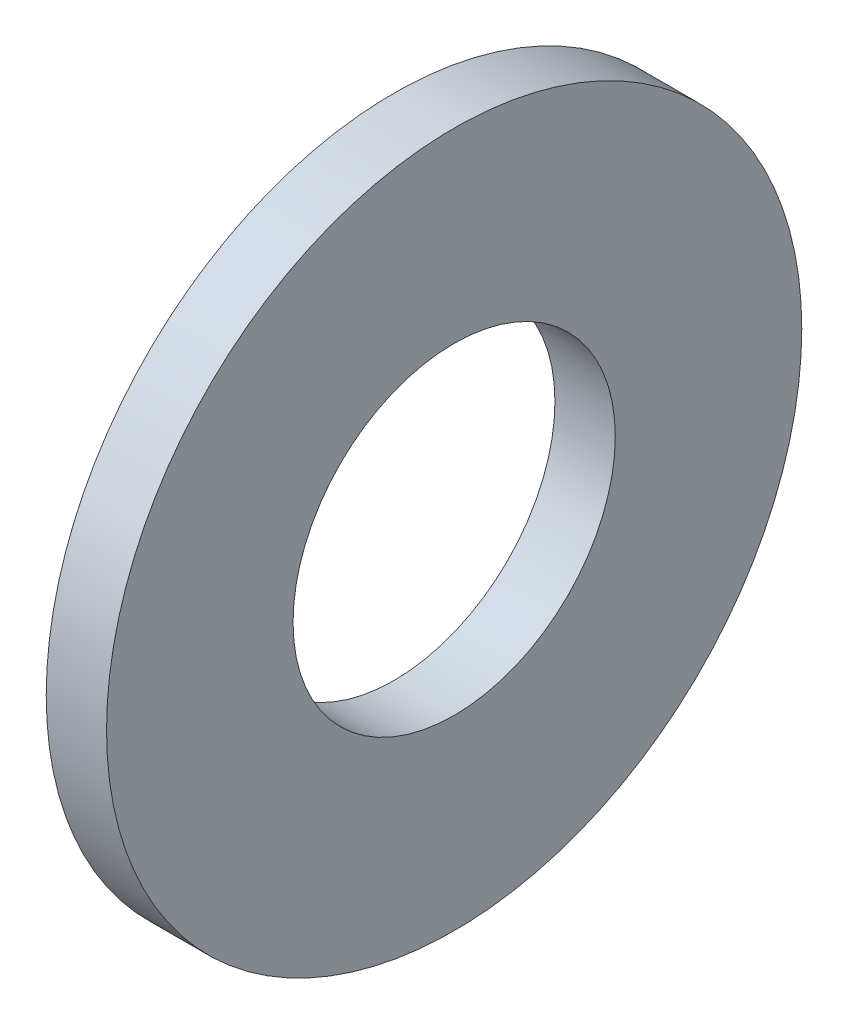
from build123d import *

# Parameters (mm, degrees)
SKETCH1_R           = 5.5626
SKETCH1_R_2         = 2.5781
BOSS_EXTRUDE1_DEPTH = 0.9652


with BuildPart() as part:
    # Sketch1 → Boss-Extrude1 (new body)
    with BuildSketch(Plane(origin=(0, 0, 0), x_dir=(0, 0, -1), z_dir=(1, 0, 0))):
        with Locations(Location((0, 0, 0), (0, 0, 180))):
            Circle(SKETCH1_R)
        with Locations(Location((0, 0, 0), (0, 0, 180))):
            Circle(SKETCH1_R_2, mode=Mode.SUBTRACT)
    extrude(amount=BOSS_EXTRUDE1_DEPTH)


solid = part.part
